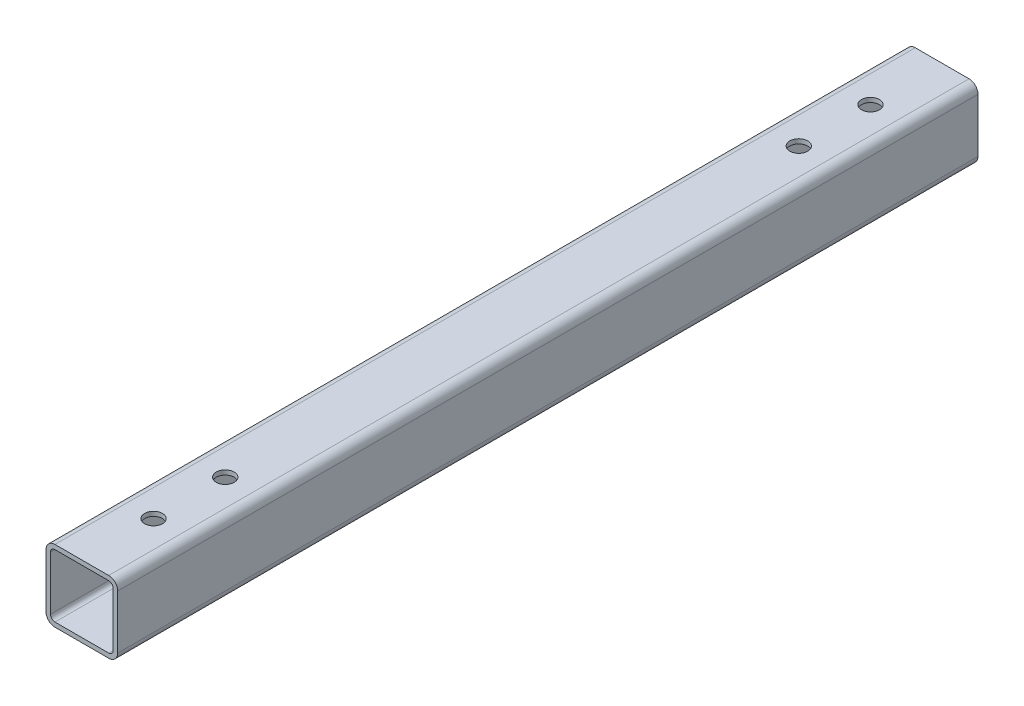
from build123d import *

# Parameters (mm, degrees)
SKETCH1_W          = 25.4
SKETCH1_H          = 25.4
BASE_EXTRUDE_DEPTH = 152.4
FILLET1_R          = 3.175
SHELL1_T           = -1.5875
SKETCH5_R          = 3.175
CUT_EXTRUDE2_DEPTH = 156.02325632


with BuildPart() as part:
    # Sketch1 → Base-Extrude (new, symmetric)
    with BuildSketch(Plane.XY):
        Rectangle(SKETCH1_W, SKETCH1_H)
    extrude(amount=BASE_EXTRUDE_DEPTH, both=True)

    # Fillet1
    fillet1_edges = [part.edges().sort_by_distance(p)[0] for p in [
        (-12.7, 12.7, 0),
        (12.7, 12.7, 0),
        (12.7, -12.7, 0),
        (-12.7, -12.7, 0),
    ]]
    fillet(fillet1_edges, radius=FILLET1_R)

    # Shell1
    shell1_openings = [part.faces().sort_by_distance(p)[0] for p in [
        (0, 0, 152.4),
        (0, 0, -152.4),
    ]]
    offset(amount=SHELL1_T, openings=shell1_openings, kind=Kind.INTERSECTION)

    # Sketch5 → Cut-Extrude2 (cut, through all)
    with BuildSketch(Plane.XZ.offset(12.7)):
        with Locations((0, 127)):
            Circle(SKETCH5_R)
        with Locations((0, 101.6)):
            Circle(SKETCH5_R)
        with Locations((0, -127)):
            Circle(SKETCH5_R)
        with Locations((0, -101.6)):
            Circle(SKETCH5_R)
    extrude(amount=-CUT_EXTRUDE2_DEPTH, mode=Mode.SUBTRACT)


solid = part.part
